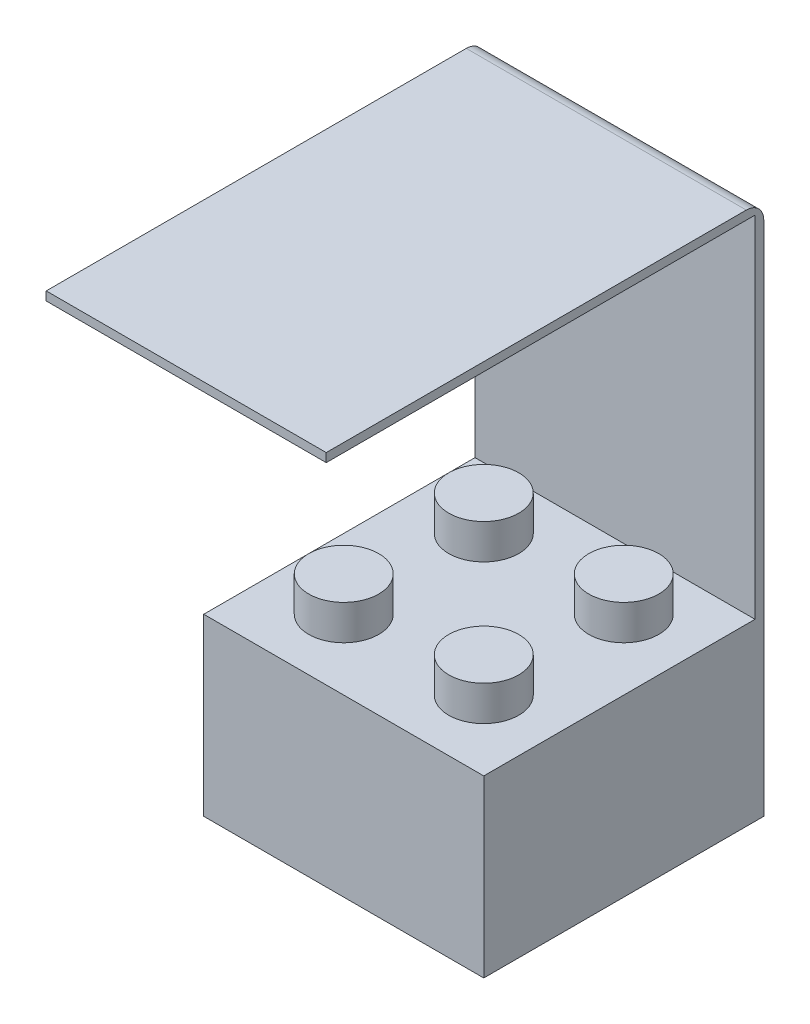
ISO-10303-21;
HEADER;
FILE_DESCRIPTION(('STEP AP214'),'2;1');
FILE_NAME('part.step','',(''),(''),'','','');
FILE_SCHEMA(('AUTOMOTIVE_DESIGN { 1 0 10303 214 1 1 1 1 }'));
ENDSEC;
DATA;
#1=APPLICATION_CONTEXT('core data for automotive mechanical design processes');
#2=APPLICATION_PROTOCOL_DEFINITION('international standard','automotive_design',2000,#1);
#3=PRODUCT_CONTEXT('',#1,'mechanical');
#4=PRODUCT('Part','Part','',(#3));
#5=PRODUCT_RELATED_PRODUCT_CATEGORY('part','',(#4));
#6=PRODUCT_DEFINITION_FORMATION('','',#4);
#7=PRODUCT_DEFINITION_CONTEXT('part definition',#1,'design');
#8=PRODUCT_DEFINITION('design','',#6,#7);
#9=PRODUCT_DEFINITION_SHAPE('','',#8);
#10=(LENGTH_UNIT() NAMED_UNIT(*) SI_UNIT(.MILLI.,.METRE.));
#11=(NAMED_UNIT(*) PLANE_ANGLE_UNIT() SI_UNIT($,.RADIAN.));
#12=(NAMED_UNIT(*) SI_UNIT($,.STERADIAN.) SOLID_ANGLE_UNIT());
#13=UNCERTAINTY_MEASURE_WITH_UNIT(LENGTH_MEASURE(1.E-05),#10,'distance_accuracy_value','');
#14=(GEOMETRIC_REPRESENTATION_CONTEXT(3) GLOBAL_UNCERTAINTY_ASSIGNED_CONTEXT((#13)) GLOBAL_UNIT_ASSIGNED_CONTEXT((#10,
#11,#12)) REPRESENTATION_CONTEXT('',''));
#15=CARTESIAN_POINT('',(0.,0.,0.));
#16=DIRECTION('',(0.,0.,1.));
#17=DIRECTION('',(1.,0.,0.));
#18=AXIS2_PLACEMENT_3D('',#15,#16,#17);
#19=CARTESIAN_POINT('',(0.,10.,0.));
#20=DIRECTION('',(0.,1.,0.));
#21=DIRECTION('',(0.,0.,1.));
#22=AXIS2_PLACEMENT_3D('',#19,#20,#21);
#23=PLANE('',#22);
#24=CARTESIAN_POINT('',(-4.00000000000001,10.,4.));
#25=DIRECTION('',(0.,1.,0.));
#26=DIRECTION('',(0.,0.,-1.));
#27=AXIS2_PLACEMENT_3D('',#24,#25,#26);
#28=CIRCLE('',#27,2.);
#29=CARTESIAN_POINT('',(-4.00000000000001,10.,2.));
#30=VERTEX_POINT('',#29);
#31=EDGE_CURVE('E226',#30,#30,#28,.T.);
#32=ORIENTED_EDGE('',*,*,#31,.F.);
#33=EDGE_LOOP('',(#32));
#34=FACE_BOUND('',#33,.T.);
#35=CARTESIAN_POINT('',(4.,10.,-4.00000000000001));
#36=DIRECTION('',(0.,1.,0.));
#37=DIRECTION('',(0.,0.,-1.));
#38=AXIS2_PLACEMENT_3D('',#35,#36,#37);
#39=CIRCLE('',#38,2.);
#40=CARTESIAN_POINT('',(4.,10.,-6.00000000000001));
#41=VERTEX_POINT('',#40);
#42=EDGE_CURVE('E261',#41,#41,#39,.T.);
#43=ORIENTED_EDGE('',*,*,#42,.F.);
#44=EDGE_LOOP('',(#43));
#45=FACE_BOUND('',#44,.T.);
#46=CARTESIAN_POINT('',(-4.,10.,-4.));
#47=DIRECTION('',(0.,1.,0.));
#48=DIRECTION('',(0.,0.,1.));
#49=AXIS2_PLACEMENT_3D('',#46,#47,#48);
#50=CIRCLE('',#49,2.);
#51=CARTESIAN_POINT('',(-4.,10.,-2.));
#52=VERTEX_POINT('',#51);
#53=EDGE_CURVE('E267',#52,#52,#50,.T.);
#54=ORIENTED_EDGE('',*,*,#53,.F.);
#55=EDGE_LOOP('',(#54));
#56=FACE_BOUND('',#55,.T.);
#57=CARTESIAN_POINT('',(4.,10.,4.00000000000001));
#58=DIRECTION('',(0.,1.,0.));
#59=DIRECTION('',(0.,0.,1.));
#60=AXIS2_PLACEMENT_3D('',#57,#58,#59);
#61=CIRCLE('',#60,2.);
#62=CARTESIAN_POINT('',(4.,10.,6.00000000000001));
#63=VERTEX_POINT('',#62);
#64=EDGE_CURVE('E255',#63,#63,#61,.T.);
#65=ORIENTED_EDGE('',*,*,#64,.F.);
#66=EDGE_LOOP('',(#65));
#67=FACE_BOUND('',#66,.T.);
#68=DIRECTION('',(0.,0.,-1.));
#69=VECTOR('',#68,1.);
#70=CARTESIAN_POINT('',(8.,10.,-8.));
#71=LINE('',#70,#69);
#72=CARTESIAN_POINT('',(8.,10.,8.));
#73=VERTEX_POINT('',#72);
#74=CARTESIAN_POINT('',(8.,10.,-7.5));
#75=VERTEX_POINT('',#74);
#76=EDGE_CURVE('E276',#73,#75,#71,.T.);
#77=ORIENTED_EDGE('',*,*,#76,.T.);
#78=DIRECTION('',(1.,0.,0.));
#79=VECTOR('',#78,1.);
#80=CARTESIAN_POINT('',(7.5,10.,-7.5));
#81=LINE('',#80,#79);
#82=CARTESIAN_POINT('',(-8.,10.,-7.5));
#83=VERTEX_POINT('',#82);
#84=EDGE_CURVE('E149',#83,#75,#81,.T.);
#85=ORIENTED_EDGE('',*,*,#84,.F.);
#86=DIRECTION('',(0.,0.,1.));
#87=VECTOR('',#86,1.);
#88=CARTESIAN_POINT('',(-8.,10.,-8.));
#89=LINE('',#88,#87);
#90=CARTESIAN_POINT('',(-8.,10.,8.));
#91=VERTEX_POINT('',#90);
#92=EDGE_CURVE('E278',#83,#91,#89,.T.);
#93=ORIENTED_EDGE('',*,*,#92,.T.);
#94=DIRECTION('',(1.,0.,0.));
#95=VECTOR('',#94,1.);
#96=CARTESIAN_POINT('',(-8.,10.,8.));
#97=LINE('',#96,#95);
#98=EDGE_CURVE('E281',#91,#73,#97,.T.);
#99=ORIENTED_EDGE('',*,*,#98,.T.);
#100=EDGE_LOOP('',(#77,#85,#93,#99));
#101=FACE_BOUND('',#100,.T.);
#102=ADVANCED_FACE('F33',(#34,#45,#56,#67,#101),#23,.T.);
#103=CARTESIAN_POINT('',(0.,9.,0.));
#104=DIRECTION('',(0.,1.,0.));
#105=DIRECTION('',(0.,0.,1.));
#106=AXIS2_PLACEMENT_3D('',#103,#104,#105);
#107=PLANE('',#106);
#108=CARTESIAN_POINT('',(4.,9.,4.00000000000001));
#109=DIRECTION('',(0.,1.,0.));
#110=DIRECTION('',(0.,0.,1.));
#111=AXIS2_PLACEMENT_3D('',#108,#109,#110);
#112=CIRCLE('',#111,1.);
#113=CARTESIAN_POINT('',(4.,9.,5.00000000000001));
#114=VERTEX_POINT('',#113);
#115=EDGE_CURVE('E197',#114,#114,#112,.T.);
#116=ORIENTED_EDGE('',*,*,#115,.T.);
#117=EDGE_LOOP('',(#116));
#118=FACE_BOUND('',#117,.T.);
#119=CARTESIAN_POINT('',(-4.,9.,-4.));
#120=DIRECTION('',(0.,1.,0.));
#121=DIRECTION('',(0.,0.,1.));
#122=AXIS2_PLACEMENT_3D('',#119,#120,#121);
#123=CIRCLE('',#122,1.);
#124=CARTESIAN_POINT('',(-4.,9.,-3.));
#125=VERTEX_POINT('',#124);
#126=EDGE_CURVE('E202',#125,#125,#123,.T.);
#127=ORIENTED_EDGE('',*,*,#126,.T.);
#128=EDGE_LOOP('',(#127));
#129=FACE_BOUND('',#128,.T.);
#130=DIRECTION('',(0.,0.,-1.));
#131=VECTOR('',#130,1.);
#132=CARTESIAN_POINT('',(7.,9.,-8.));
#133=LINE('',#132,#131);
#134=CARTESIAN_POINT('',(7.,9.,7.));
#135=VERTEX_POINT('',#134);
#136=CARTESIAN_POINT('',(7.,9.,-7.));
#137=VERTEX_POINT('',#136);
#138=EDGE_CURVE('E207',#135,#137,#133,.T.);
#139=ORIENTED_EDGE('',*,*,#138,.F.);
#140=DIRECTION('',(1.,0.,0.));
#141=VECTOR('',#140,1.);
#142=CARTESIAN_POINT('',(-8.,9.,7.));
#143=LINE('',#142,#141);
#144=CARTESIAN_POINT('',(-7.,9.,7.));
#145=VERTEX_POINT('',#144);
#146=EDGE_CURVE('E215',#145,#135,#143,.T.);
#147=ORIENTED_EDGE('',*,*,#146,.F.);
#148=DIRECTION('',(0.,0.,1.));
#149=VECTOR('',#148,1.);
#150=CARTESIAN_POINT('',(-7.,9.,-8.));
#151=LINE('',#150,#149);
#152=CARTESIAN_POINT('',(-7.,9.,-7.));
#153=VERTEX_POINT('',#152);
#154=EDGE_CURVE('E213',#153,#145,#151,.T.);
#155=ORIENTED_EDGE('',*,*,#154,.F.);
#156=DIRECTION('',(-1.,0.,0.));
#157=VECTOR('',#156,1.);
#158=CARTESIAN_POINT('',(-8.,9.,-7.));
#159=LINE('',#158,#157);
#160=EDGE_CURVE('E210',#137,#153,#159,.T.);
#161=ORIENTED_EDGE('',*,*,#160,.F.);
#162=EDGE_LOOP('',(#139,#147,#155,#161));
#163=FACE_BOUND('',#162,.T.);
#164=CARTESIAN_POINT('',(4.,9.,-4.00000000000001));
#165=DIRECTION('',(0.,1.,0.));
#166=DIRECTION('',(0.,0.,1.));
#167=AXIS2_PLACEMENT_3D('',#164,#165,#166);
#168=CIRCLE('',#167,1.);
#169=CARTESIAN_POINT('',(4.,9.,-3.));
#170=VERTEX_POINT('',#169);
#171=EDGE_CURVE('E218',#170,#170,#168,.T.);
#172=ORIENTED_EDGE('',*,*,#171,.T.);
#173=EDGE_LOOP('',(#172));
#174=FACE_BOUND('',#173,.T.);
#175=CARTESIAN_POINT('',(-4.00000000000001,9.,4.));
#176=DIRECTION('',(0.,1.,0.));
#177=DIRECTION('',(0.,0.,1.));
#178=AXIS2_PLACEMENT_3D('',#175,#176,#177);
#179=CIRCLE('',#178,1.);
#180=CARTESIAN_POINT('',(-4.00000000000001,9.,5.));
#181=VERTEX_POINT('',#180);
#182=EDGE_CURVE('E196',#181,#181,#179,.T.);
#183=ORIENTED_EDGE('',*,*,#182,.T.);
#184=EDGE_LOOP('',(#183));
#185=FACE_BOUND('',#184,.T.);
#186=CARTESIAN_POINT('',(0.,9.,0.));
#187=DIRECTION('',(0.,1.,0.));
#188=DIRECTION('',(0.,0.,1.));
#189=AXIS2_PLACEMENT_3D('',#186,#187,#188);
#190=CIRCLE('',#189,2.7);
#191=CARTESIAN_POINT('',(0.,9.,2.7));
#192=VERTEX_POINT('',#191);
#193=EDGE_CURVE('E301',#192,#192,#190,.F.);
#194=ORIENTED_EDGE('',*,*,#193,.F.);
#195=EDGE_LOOP('',(#194));
#196=FACE_BOUND('',#195,.T.);
#197=ADVANCED_FACE('F310',(#118,#129,#163,#174,#185,#196),#107,.F.);
#198=CARTESIAN_POINT('',(8.,10.,-8.));
#199=DIRECTION('',(-1.,0.,0.));
#200=DIRECTION('',(0.,0.,1.));
#201=AXIS2_PLACEMENT_3D('',#198,#199,#200);
#202=PLANE('',#201);
#203=DIRECTION('',(0.,-1.,0.));
#204=VECTOR('',#203,1.);
#205=CARTESIAN_POINT('',(8.,10.,-8.));
#206=LINE('',#205,#204);
#207=CARTESIAN_POINT('',(8.,29.5,-8.));
#208=VERTEX_POINT('',#207);
#209=CARTESIAN_POINT('',(8.,0.,-8.));
#210=VERTEX_POINT('',#209);
#211=EDGE_CURVE('E299',#208,#210,#206,.T.);
#212=ORIENTED_EDGE('',*,*,#211,.F.);
#213=CARTESIAN_POINT('',(8.,29.5,-7.));
#214=DIRECTION('',(-1.,0.,0.));
#215=DIRECTION('',(0.,0.,1.));
#216=AXIS2_PLACEMENT_3D('',#213,#214,#215);
#217=CIRCLE('',#216,1.);
#218=CARTESIAN_POINT('',(8.,30.5,-7.));
#219=VERTEX_POINT('',#218);
#220=EDGE_CURVE('E11',#208,#219,#217,.F.);
#221=ORIENTED_EDGE('',*,*,#220,.T.);
#222=DIRECTION('',(0.,0.,-1.));
#223=VECTOR('',#222,1.);
#224=CARTESIAN_POINT('',(8.,30.5,-8.));
#225=LINE('',#224,#223);
#226=CARTESIAN_POINT('',(8.,30.5,17.));
#227=VERTEX_POINT('',#226);
#228=EDGE_CURVE('E143',#227,#219,#225,.T.);
#229=ORIENTED_EDGE('',*,*,#228,.F.);
#230=DIRECTION('',(0.,-1.,0.));
#231=VECTOR('',#230,1.);
#232=CARTESIAN_POINT('',(8.,30.5,17.));
#233=LINE('',#232,#231);
#234=CARTESIAN_POINT('',(8.,30.,17.));
#235=VERTEX_POINT('',#234);
#236=EDGE_CURVE('E141',#227,#235,#233,.T.);
#237=ORIENTED_EDGE('',*,*,#236,.T.);
#238=DIRECTION('',(0.,0.,-1.));
#239=VECTOR('',#238,1.);
#240=CARTESIAN_POINT('',(8.,30.,-8.));
#241=LINE('',#240,#239);
#242=CARTESIAN_POINT('',(8.,30.,-7.5));
#243=VERTEX_POINT('',#242);
#244=EDGE_CURVE('E134',#235,#243,#241,.T.);
#245=ORIENTED_EDGE('',*,*,#244,.T.);
#246=DIRECTION('',(0.,-1.,0.));
#247=VECTOR('',#246,1.);
#248=CARTESIAN_POINT('',(8.,30.,-7.5));
#249=LINE('',#248,#247);
#250=EDGE_CURVE('E171',#243,#75,#249,.T.);
#251=ORIENTED_EDGE('',*,*,#250,.T.);
#252=ORIENTED_EDGE('',*,*,#76,.F.);
#253=DIRECTION('',(0.,-1.,0.));
#254=VECTOR('',#253,1.);
#255=CARTESIAN_POINT('',(8.,10.,8.));
#256=LINE('',#255,#254);
#257=CARTESIAN_POINT('',(8.,0.,8.));
#258=VERTEX_POINT('',#257);
#259=EDGE_CURVE('E283',#73,#258,#256,.T.);
#260=ORIENTED_EDGE('',*,*,#259,.T.);
#261=DIRECTION('',(0.,0.,-1.));
#262=VECTOR('',#261,1.);
#263=CARTESIAN_POINT('',(8.,0.,-8.));
#264=LINE('',#263,#262);
#265=EDGE_CURVE('E273',#258,#210,#264,.T.);
#266=ORIENTED_EDGE('',*,*,#265,.T.);
#267=EDGE_LOOP('',(#212,#221,#229,#237,#245,#251,#252,#260,#266));
#268=FACE_BOUND('',#267,.T.);
#269=ADVANCED_FACE('F169',(#268),#202,.F.);
#270=CARTESIAN_POINT('',(-8.,10.,-8.));
#271=DIRECTION('',(0.,0.,1.));
#272=DIRECTION('',(1.,0.,0.));
#273=AXIS2_PLACEMENT_3D('',#270,#271,#272);
#274=PLANE('',#273);
#275=DIRECTION('',(0.,-1.,0.));
#276=VECTOR('',#275,1.);
#277=CARTESIAN_POINT('',(-8.,10.,-8.));
#278=LINE('',#277,#276);
#279=CARTESIAN_POINT('',(-8.,29.5,-8.));
#280=VERTEX_POINT('',#279);
#281=CARTESIAN_POINT('',(-8.,0.,-8.));
#282=VERTEX_POINT('',#281);
#283=EDGE_CURVE('E297',#280,#282,#278,.T.);
#284=ORIENTED_EDGE('',*,*,#283,.F.);
#285=DIRECTION('',(-1.,0.,0.));
#286=VECTOR('',#285,1.);
#287=CARTESIAN_POINT('',(8.,29.5,-8.));
#288=LINE('',#287,#286);
#289=EDGE_CURVE('E41',#280,#208,#288,.F.);
#290=ORIENTED_EDGE('',*,*,#289,.T.);
#291=ORIENTED_EDGE('',*,*,#211,.T.);
#292=DIRECTION('',(-1.,0.,0.));
#293=VECTOR('',#292,1.);
#294=CARTESIAN_POINT('',(-8.,0.,-8.));
#295=LINE('',#294,#293);
#296=EDGE_CURVE('E286',#210,#282,#295,.T.);
#297=ORIENTED_EDGE('',*,*,#296,.T.);
#298=EDGE_LOOP('',(#284,#290,#291,#297));
#299=FACE_BOUND('',#298,.T.);
#300=ADVANCED_FACE('F319',(#299),#274,.F.);
#301=CARTESIAN_POINT('',(-8.,10.,-8.));
#302=DIRECTION('',(1.,0.,0.));
#303=DIRECTION('',(0.,0.,-1.));
#304=AXIS2_PLACEMENT_3D('',#301,#302,#303);
#305=PLANE('',#304);
#306=DIRECTION('',(0.,0.,1.));
#307=VECTOR('',#306,1.);
#308=CARTESIAN_POINT('',(-8.,30.5,-8.));
#309=LINE('',#308,#307);
#310=CARTESIAN_POINT('',(-8.,30.5,-7.));
#311=VERTEX_POINT('',#310);
#312=CARTESIAN_POINT('',(-8.,30.5,17.));
#313=VERTEX_POINT('',#312);
#314=EDGE_CURVE('E125',#311,#313,#309,.T.);
#315=ORIENTED_EDGE('',*,*,#314,.F.);
#316=CARTESIAN_POINT('',(-8.,29.5,-7.));
#317=DIRECTION('',(1.,0.,0.));
#318=DIRECTION('',(0.,0.,-1.));
#319=AXIS2_PLACEMENT_3D('',#316,#317,#318);
#320=CIRCLE('',#319,1.);
#321=EDGE_CURVE('E55',#311,#280,#320,.F.);
#322=ORIENTED_EDGE('',*,*,#321,.T.);
#323=ORIENTED_EDGE('',*,*,#283,.T.);
#324=DIRECTION('',(0.,0.,1.));
#325=VECTOR('',#324,1.);
#326=CARTESIAN_POINT('',(-8.,0.,-8.));
#327=LINE('',#326,#325);
#328=CARTESIAN_POINT('',(-8.,0.,8.));
#329=VERTEX_POINT('',#328);
#330=EDGE_CURVE('E289',#282,#329,#327,.T.);
#331=ORIENTED_EDGE('',*,*,#330,.T.);
#332=DIRECTION('',(0.,-1.,0.));
#333=VECTOR('',#332,1.);
#334=CARTESIAN_POINT('',(-8.,10.,8.));
#335=LINE('',#334,#333);
#336=EDGE_CURVE('E294',#91,#329,#335,.T.);
#337=ORIENTED_EDGE('',*,*,#336,.F.);
#338=ORIENTED_EDGE('',*,*,#92,.F.);
#339=DIRECTION('',(0.,-1.,0.));
#340=VECTOR('',#339,1.);
#341=CARTESIAN_POINT('',(-8.,30.,-7.5));
#342=LINE('',#341,#340);
#343=CARTESIAN_POINT('',(-8.,30.,-7.5));
#344=VERTEX_POINT('',#343);
#345=EDGE_CURVE('E178',#344,#83,#342,.T.);
#346=ORIENTED_EDGE('',*,*,#345,.F.);
#347=DIRECTION('',(0.,0.,1.));
#348=VECTOR('',#347,1.);
#349=CARTESIAN_POINT('',(-8.,30.,-8.));
#350=LINE('',#349,#348);
#351=CARTESIAN_POINT('',(-8.,30.,17.));
#352=VERTEX_POINT('',#351);
#353=EDGE_CURVE('E147',#344,#352,#350,.T.);
#354=ORIENTED_EDGE('',*,*,#353,.T.);
#355=DIRECTION('',(0.,-1.,0.));
#356=VECTOR('',#355,1.);
#357=CARTESIAN_POINT('',(-8.,30.5,17.));
#358=LINE('',#357,#356);
#359=EDGE_CURVE('E139',#313,#352,#358,.T.);
#360=ORIENTED_EDGE('',*,*,#359,.F.);
#361=EDGE_LOOP('',(#315,#322,#323,#331,#337,#338,#346,#354,#360));
#362=FACE_BOUND('',#361,.T.);
#363=ADVANCED_FACE('F145',(#362),#305,.F.);
#364=CARTESIAN_POINT('',(-8.,10.,8.));
#365=DIRECTION('',(0.,0.,-1.));
#366=DIRECTION('',(-1.,0.,0.));
#367=AXIS2_PLACEMENT_3D('',#364,#365,#366);
#368=PLANE('',#367);
#369=DIRECTION('',(1.,0.,0.));
#370=VECTOR('',#369,1.);
#371=CARTESIAN_POINT('',(-8.,0.,8.));
#372=LINE('',#371,#370);
#373=EDGE_CURVE('E279',#329,#258,#372,.T.);
#374=ORIENTED_EDGE('',*,*,#373,.T.);
#375=ORIENTED_EDGE('',*,*,#259,.F.);
#376=ORIENTED_EDGE('',*,*,#98,.F.);
#377=ORIENTED_EDGE('',*,*,#336,.T.);
#378=EDGE_LOOP('',(#374,#375,#376,#377));
#379=FACE_BOUND('',#378,.T.);
#380=ADVANCED_FACE('F404',(#379),#368,.F.);
#381=CARTESIAN_POINT('',(0.,0.,0.));
#382=DIRECTION('',(0.,1.,0.));
#383=DIRECTION('',(0.,0.,1.));
#384=AXIS2_PLACEMENT_3D('',#381,#382,#383);
#385=PLANE('',#384);
#386=DIRECTION('',(1.,0.,0.));
#387=VECTOR('',#386,1.);
#388=CARTESIAN_POINT('',(-8.,0.,7.));
#389=LINE('',#388,#387);
#390=CARTESIAN_POINT('',(-7.,0.,7.));
#391=VERTEX_POINT('',#390);
#392=CARTESIAN_POINT('',(7.,0.,7.));
#393=VERTEX_POINT('',#392);
#394=EDGE_CURVE('E211',#391,#393,#389,.T.);
#395=ORIENTED_EDGE('',*,*,#394,.T.);
#396=DIRECTION('',(0.,0.,-1.));
#397=VECTOR('',#396,1.);
#398=CARTESIAN_POINT('',(7.,0.,-8.));
#399=LINE('',#398,#397);
#400=CARTESIAN_POINT('',(7.,0.,-7.));
#401=VERTEX_POINT('',#400);
#402=EDGE_CURVE('E235',#393,#401,#399,.T.);
#403=ORIENTED_EDGE('',*,*,#402,.T.);
#404=DIRECTION('',(-1.,0.,0.));
#405=VECTOR('',#404,1.);
#406=CARTESIAN_POINT('',(-8.,0.,-7.));
#407=LINE('',#406,#405);
#408=CARTESIAN_POINT('',(-7.,0.,-7.));
#409=VERTEX_POINT('',#408);
#410=EDGE_CURVE('E244',#401,#409,#407,.T.);
#411=ORIENTED_EDGE('',*,*,#410,.T.);
#412=DIRECTION('',(0.,0.,1.));
#413=VECTOR('',#412,1.);
#414=CARTESIAN_POINT('',(-7.,0.,-8.));
#415=LINE('',#414,#413);
#416=EDGE_CURVE('E247',#409,#391,#415,.T.);
#417=ORIENTED_EDGE('',*,*,#416,.T.);
#418=EDGE_LOOP('',(#395,#403,#411,#417));
#419=FACE_BOUND('',#418,.T.);
#420=ORIENTED_EDGE('',*,*,#265,.F.);
#421=ORIENTED_EDGE('',*,*,#373,.F.);
#422=ORIENTED_EDGE('',*,*,#330,.F.);
#423=ORIENTED_EDGE('',*,*,#296,.F.);
#424=EDGE_LOOP('',(#420,#421,#422,#423));
#425=FACE_BOUND('',#424,.T.);
#426=ADVANCED_FACE('F399',(#419,#425),#385,.F.);
#427=CARTESIAN_POINT('',(-4.,12.,-4.));
#428=DIRECTION('',(0.,-1.,0.));
#429=DIRECTION('',(0.,0.,-1.));
#430=AXIS2_PLACEMENT_3D('',#427,#428,#429);
#431=CYLINDRICAL_SURFACE('',#430,2.);
#432=CARTESIAN_POINT('',(-4.,12.,-4.));
#433=DIRECTION('',(0.,1.,0.));
#434=DIRECTION('',(0.,0.,1.));
#435=AXIS2_PLACEMENT_3D('',#432,#433,#434);
#436=CIRCLE('',#435,2.);
#437=CARTESIAN_POINT('',(-4.,12.,-2.));
#438=VERTEX_POINT('',#437);
#439=EDGE_CURVE('E270',#438,#438,#436,.T.);
#440=ORIENTED_EDGE('',*,*,#439,.F.);
#441=EDGE_LOOP('',(#440));
#442=FACE_BOUND('',#441,.T.);
#443=ORIENTED_EDGE('',*,*,#53,.T.);
#444=EDGE_LOOP('',(#443));
#445=FACE_BOUND('',#444,.T.);
#446=ADVANCED_FACE('F396',(#442,#445),#431,.T.);
#447=CARTESIAN_POINT('',(-4.,12.,-4.));
#448=DIRECTION('',(0.,1.,0.));
#449=DIRECTION('',(0.,0.,1.));
#450=AXIS2_PLACEMENT_3D('',#447,#448,#449);
#451=PLANE('',#450);
#452=ORIENTED_EDGE('',*,*,#439,.T.);
#453=EDGE_LOOP('',(#452));
#454=FACE_BOUND('',#453,.T.);
#455=ADVANCED_FACE('F392',(#454),#451,.T.);
#456=CARTESIAN_POINT('',(4.,12.,-4.00000000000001));
#457=DIRECTION('',(0.,-1.,0.));
#458=DIRECTION('',(0.,0.,-1.));
#459=AXIS2_PLACEMENT_3D('',#456,#457,#458);
#460=CYLINDRICAL_SURFACE('',#459,2.);
#461=CARTESIAN_POINT('',(4.,12.,-4.00000000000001));
#462=DIRECTION('',(0.,1.,0.));
#463=DIRECTION('',(0.,0.,-1.));
#464=AXIS2_PLACEMENT_3D('',#461,#462,#463);
#465=CIRCLE('',#464,2.);
#466=CARTESIAN_POINT('',(4.,12.,-6.00000000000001));
#467=VERTEX_POINT('',#466);
#468=EDGE_CURVE('E264',#467,#467,#465,.T.);
#469=ORIENTED_EDGE('',*,*,#468,.F.);
#470=EDGE_LOOP('',(#469));
#471=FACE_BOUND('',#470,.T.);
#472=ORIENTED_EDGE('',*,*,#42,.T.);
#473=EDGE_LOOP('',(#472));
#474=FACE_BOUND('',#473,.T.);
#475=ADVANCED_FACE('F388',(#471,#474),#460,.T.);
#476=CARTESIAN_POINT('',(4.,12.,-4.00000000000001));
#477=DIRECTION('',(0.,-1.,0.));
#478=DIRECTION('',(0.,0.,-1.));
#479=AXIS2_PLACEMENT_3D('',#476,#477,#478);
#480=PLANE('',#479);
#481=ORIENTED_EDGE('',*,*,#468,.T.);
#482=EDGE_LOOP('',(#481));
#483=FACE_BOUND('',#482,.T.);
#484=ADVANCED_FACE('F384',(#483),#480,.F.);
#485=CARTESIAN_POINT('',(4.,12.,4.00000000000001));
#486=DIRECTION('',(0.,-1.,0.));
#487=DIRECTION('',(0.,0.,-1.));
#488=AXIS2_PLACEMENT_3D('',#485,#486,#487);
#489=CYLINDRICAL_SURFACE('',#488,2.);
#490=CARTESIAN_POINT('',(4.,12.,4.00000000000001));
#491=DIRECTION('',(0.,1.,0.));
#492=DIRECTION('',(0.,0.,1.));
#493=AXIS2_PLACEMENT_3D('',#490,#491,#492);
#494=CIRCLE('',#493,2.);
#495=CARTESIAN_POINT('',(4.,12.,6.00000000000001));
#496=VERTEX_POINT('',#495);
#497=EDGE_CURVE('E258',#496,#496,#494,.T.);
#498=ORIENTED_EDGE('',*,*,#497,.F.);
#499=EDGE_LOOP('',(#498));
#500=FACE_BOUND('',#499,.T.);
#501=ORIENTED_EDGE('',*,*,#64,.T.);
#502=EDGE_LOOP('',(#501));
#503=FACE_BOUND('',#502,.T.);
#504=ADVANCED_FACE('F380',(#500,#503),#489,.T.);
#505=CARTESIAN_POINT('',(4.,12.,4.00000000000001));
#506=DIRECTION('',(0.,1.,0.));
#507=DIRECTION('',(0.,0.,1.));
#508=AXIS2_PLACEMENT_3D('',#505,#506,#507);
#509=PLANE('',#508);
#510=ORIENTED_EDGE('',*,*,#497,.T.);
#511=EDGE_LOOP('',(#510));
#512=FACE_BOUND('',#511,.T.);
#513=ADVANCED_FACE('F376',(#512),#509,.T.);
#514=CARTESIAN_POINT('',(-4.00000000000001,12.,4.));
#515=DIRECTION('',(0.,-1.,0.));
#516=DIRECTION('',(0.,0.,-1.));
#517=AXIS2_PLACEMENT_3D('',#514,#515,#516);
#518=CYLINDRICAL_SURFACE('',#517,2.);
#519=CARTESIAN_POINT('',(-4.00000000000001,12.,4.));
#520=DIRECTION('',(0.,1.,0.));
#521=DIRECTION('',(0.,0.,-1.));
#522=AXIS2_PLACEMENT_3D('',#519,#520,#521);
#523=CIRCLE('',#522,2.);
#524=CARTESIAN_POINT('',(-4.00000000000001,12.,2.));
#525=VERTEX_POINT('',#524);
#526=EDGE_CURVE('E252',#525,#525,#523,.T.);
#527=ORIENTED_EDGE('',*,*,#526,.F.);
#528=EDGE_LOOP('',(#527));
#529=FACE_BOUND('',#528,.T.);
#530=ORIENTED_EDGE('',*,*,#31,.T.);
#531=EDGE_LOOP('',(#530));
#532=FACE_BOUND('',#531,.T.);
#533=ADVANCED_FACE('F372',(#529,#532),#518,.T.);
#534=CARTESIAN_POINT('',(-4.00000000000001,12.,4.));
#535=DIRECTION('',(0.,-1.,0.));
#536=DIRECTION('',(0.,0.,-1.));
#537=AXIS2_PLACEMENT_3D('',#534,#535,#536);
#538=PLANE('',#537);
#539=ORIENTED_EDGE('',*,*,#526,.T.);
#540=EDGE_LOOP('',(#539));
#541=FACE_BOUND('',#540,.T.);
#542=ADVANCED_FACE('F368',(#541),#538,.F.);
#543=CARTESIAN_POINT('',(7.,10.,-8.));
#544=DIRECTION('',(-1.,0.,0.));
#545=DIRECTION('',(0.,0.,1.));
#546=AXIS2_PLACEMENT_3D('',#543,#544,#545);
#547=PLANE('',#546);
#548=ORIENTED_EDGE('',*,*,#402,.F.);
#549=DIRECTION('',(0.,-1.,0.));
#550=VECTOR('',#549,1.);
#551=CARTESIAN_POINT('',(7.,10.,7.));
#552=LINE('',#551,#550);
#553=EDGE_CURVE('E217',#135,#393,#552,.T.);
#554=ORIENTED_EDGE('',*,*,#553,.F.);
#555=ORIENTED_EDGE('',*,*,#138,.T.);
#556=DIRECTION('',(0.,-1.,0.));
#557=VECTOR('',#556,1.);
#558=CARTESIAN_POINT('',(7.,10.,-7.));
#559=LINE('',#558,#557);
#560=EDGE_CURVE('E223',#137,#401,#559,.T.);
#561=ORIENTED_EDGE('',*,*,#560,.T.);
#562=EDGE_LOOP('',(#548,#554,#555,#561));
#563=FACE_BOUND('',#562,.T.);
#564=ADVANCED_FACE('F371',(#563),#547,.T.);
#565=CARTESIAN_POINT('',(-8.,10.,-7.));
#566=DIRECTION('',(0.,0.,1.));
#567=DIRECTION('',(1.,0.,0.));
#568=AXIS2_PLACEMENT_3D('',#565,#566,#567);
#569=PLANE('',#568);
#570=ORIENTED_EDGE('',*,*,#410,.F.);
#571=ORIENTED_EDGE('',*,*,#560,.F.);
#572=ORIENTED_EDGE('',*,*,#160,.T.);
#573=DIRECTION('',(0.,-1.,0.));
#574=VECTOR('',#573,1.);
#575=CARTESIAN_POINT('',(-7.,10.,-7.));
#576=LINE('',#575,#574);
#577=EDGE_CURVE('E227',#153,#409,#576,.T.);
#578=ORIENTED_EDGE('',*,*,#577,.T.);
#579=EDGE_LOOP('',(#570,#571,#572,#578));
#580=FACE_BOUND('',#579,.T.);
#581=ADVANCED_FACE('F607',(#580),#569,.T.);
#582=CARTESIAN_POINT('',(-7.,10.,-8.));
#583=DIRECTION('',(1.,0.,0.));
#584=DIRECTION('',(0.,0.,-1.));
#585=AXIS2_PLACEMENT_3D('',#582,#583,#584);
#586=PLANE('',#585);
#587=ORIENTED_EDGE('',*,*,#416,.F.);
#588=ORIENTED_EDGE('',*,*,#577,.F.);
#589=ORIENTED_EDGE('',*,*,#154,.T.);
#590=DIRECTION('',(0.,-1.,0.));
#591=VECTOR('',#590,1.);
#592=CARTESIAN_POINT('',(-7.,10.,7.));
#593=LINE('',#592,#591);
#594=EDGE_CURVE('E229',#145,#391,#593,.T.);
#595=ORIENTED_EDGE('',*,*,#594,.T.);
#596=EDGE_LOOP('',(#587,#588,#589,#595));
#597=FACE_BOUND('',#596,.T.);
#598=ADVANCED_FACE('F597',(#597),#586,.T.);
#599=CARTESIAN_POINT('',(-8.,10.,7.));
#600=DIRECTION('',(0.,0.,-1.));
#601=DIRECTION('',(-1.,0.,0.));
#602=AXIS2_PLACEMENT_3D('',#599,#600,#601);
#603=PLANE('',#602);
#604=ORIENTED_EDGE('',*,*,#394,.F.);
#605=ORIENTED_EDGE('',*,*,#594,.F.);
#606=ORIENTED_EDGE('',*,*,#146,.T.);
#607=ORIENTED_EDGE('',*,*,#553,.T.);
#608=EDGE_LOOP('',(#604,#605,#606,#607));
#609=FACE_BOUND('',#608,.T.);
#610=ADVANCED_FACE('F587',(#609),#603,.T.);
#611=CARTESIAN_POINT('',(-4.,12.,-4.));
#612=DIRECTION('',(0.,-1.,0.));
#613=DIRECTION('',(0.,0.,-1.));
#614=AXIS2_PLACEMENT_3D('',#611,#612,#613);
#615=CYLINDRICAL_SURFACE('',#614,1.);
#616=CARTESIAN_POINT('',(-4.,11.,-4.));
#617=DIRECTION('',(0.,1.,0.));
#618=DIRECTION('',(0.,0.,1.));
#619=AXIS2_PLACEMENT_3D('',#616,#617,#618);
#620=CIRCLE('',#619,1.);
#621=CARTESIAN_POINT('',(-4.,11.,-3.));
#622=VERTEX_POINT('',#621);
#623=EDGE_CURVE('E205',#622,#622,#620,.T.);
#624=ORIENTED_EDGE('',*,*,#623,.T.);
#625=EDGE_LOOP('',(#624));
#626=FACE_BOUND('',#625,.T.);
#627=ORIENTED_EDGE('',*,*,#126,.F.);
#628=EDGE_LOOP('',(#627));
#629=FACE_BOUND('',#628,.T.);
#630=ADVANCED_FACE('F577',(#626,#629),#615,.F.);
#631=CARTESIAN_POINT('',(-4.,11.,-4.));
#632=DIRECTION('',(0.,1.,0.));
#633=DIRECTION('',(0.,0.,1.));
#634=AXIS2_PLACEMENT_3D('',#631,#632,#633);
#635=PLANE('',#634);
#636=ORIENTED_EDGE('',*,*,#623,.F.);
#637=EDGE_LOOP('',(#636));
#638=FACE_BOUND('',#637,.T.);
#639=ADVANCED_FACE('F567',(#638),#635,.F.);
#640=CARTESIAN_POINT('',(4.,12.,-4.00000000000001));
#641=DIRECTION('',(0.,-1.,0.));
#642=DIRECTION('',(0.,0.,-1.));
#643=AXIS2_PLACEMENT_3D('',#640,#641,#642);
#644=CYLINDRICAL_SURFACE('',#643,1.);
#645=CARTESIAN_POINT('',(4.,11.,-4.00000000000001));
#646=DIRECTION('',(0.,-1.,0.));
#647=DIRECTION('',(0.,0.,-1.));
#648=AXIS2_PLACEMENT_3D('',#645,#646,#647);
#649=CIRCLE('',#648,1.);
#650=CARTESIAN_POINT('',(4.,11.,-5.00000000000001));
#651=VERTEX_POINT('',#650);
#652=EDGE_CURVE('E206',#651,#651,#649,.F.);
#653=ORIENTED_EDGE('',*,*,#652,.T.);
#654=EDGE_LOOP('',(#653));
#655=FACE_BOUND('',#654,.T.);
#656=ORIENTED_EDGE('',*,*,#171,.F.);
#657=EDGE_LOOP('',(#656));
#658=FACE_BOUND('',#657,.T.);
#659=ADVANCED_FACE('F557',(#655,#658),#644,.F.);
#660=CARTESIAN_POINT('',(4.,11.,-4.00000000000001));
#661=DIRECTION('',(0.,-1.,0.));
#662=DIRECTION('',(0.,0.,-1.));
#663=AXIS2_PLACEMENT_3D('',#660,#661,#662);
#664=PLANE('',#663);
#665=ORIENTED_EDGE('',*,*,#652,.F.);
#666=EDGE_LOOP('',(#665));
#667=FACE_BOUND('',#666,.T.);
#668=ADVANCED_FACE('F547',(#667),#664,.T.);
#669=CARTESIAN_POINT('',(4.,12.,4.00000000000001));
#670=DIRECTION('',(0.,-1.,0.));
#671=DIRECTION('',(0.,0.,-1.));
#672=AXIS2_PLACEMENT_3D('',#669,#670,#671);
#673=CYLINDRICAL_SURFACE('',#672,1.);
#674=CARTESIAN_POINT('',(4.,11.,4.00000000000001));
#675=DIRECTION('',(0.,1.,0.));
#676=DIRECTION('',(0.,0.,1.));
#677=AXIS2_PLACEMENT_3D('',#674,#675,#676);
#678=CIRCLE('',#677,1.);
#679=CARTESIAN_POINT('',(4.,11.,5.00000000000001));
#680=VERTEX_POINT('',#679);
#681=EDGE_CURVE('E200',#680,#680,#678,.T.);
#682=ORIENTED_EDGE('',*,*,#681,.T.);
#683=EDGE_LOOP('',(#682));
#684=FACE_BOUND('',#683,.T.);
#685=ORIENTED_EDGE('',*,*,#115,.F.);
#686=EDGE_LOOP('',(#685));
#687=FACE_BOUND('',#686,.T.);
#688=ADVANCED_FACE('F538',(#684,#687),#673,.F.);
#689=CARTESIAN_POINT('',(4.,11.,4.00000000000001));
#690=DIRECTION('',(0.,1.,0.));
#691=DIRECTION('',(0.,0.,1.));
#692=AXIS2_PLACEMENT_3D('',#689,#690,#691);
#693=PLANE('',#692);
#694=ORIENTED_EDGE('',*,*,#681,.F.);
#695=EDGE_LOOP('',(#694));
#696=FACE_BOUND('',#695,.T.);
#697=ADVANCED_FACE('F362',(#696),#693,.F.);
#698=CARTESIAN_POINT('',(-4.00000000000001,12.,4.));
#699=DIRECTION('',(0.,-1.,0.));
#700=DIRECTION('',(0.,0.,-1.));
#701=AXIS2_PLACEMENT_3D('',#698,#699,#700);
#702=CYLINDRICAL_SURFACE('',#701,1.);
#703=CARTESIAN_POINT('',(-4.00000000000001,11.,4.));
#704=DIRECTION('',(0.,-1.,0.));
#705=DIRECTION('',(0.,0.,-1.));
#706=AXIS2_PLACEMENT_3D('',#703,#704,#705);
#707=CIRCLE('',#706,1.);
#708=CARTESIAN_POINT('',(-4.00000000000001,11.,3.));
#709=VERTEX_POINT('',#708);
#710=EDGE_CURVE('E201',#709,#709,#707,.F.);
#711=ORIENTED_EDGE('',*,*,#710,.T.);
#712=EDGE_LOOP('',(#711));
#713=FACE_BOUND('',#712,.T.);
#714=ORIENTED_EDGE('',*,*,#182,.F.);
#715=EDGE_LOOP('',(#714));
#716=FACE_BOUND('',#715,.T.);
#717=ADVANCED_FACE('F353',(#713,#716),#702,.F.);
#718=CARTESIAN_POINT('',(-4.00000000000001,11.,4.));
#719=DIRECTION('',(0.,-1.,0.));
#720=DIRECTION('',(0.,0.,-1.));
#721=AXIS2_PLACEMENT_3D('',#718,#719,#720);
#722=PLANE('',#721);
#723=ORIENTED_EDGE('',*,*,#710,.F.);
#724=EDGE_LOOP('',(#723));
#725=FACE_BOUND('',#724,.T.);
#726=ADVANCED_FACE('F348',(#725),#722,.T.);
#727=CARTESIAN_POINT('',(0.,0.,0.));
#728=DIRECTION('',(0.,-1.,0.));
#729=DIRECTION('',(0.,0.,-1.));
#730=AXIS2_PLACEMENT_3D('',#727,#728,#729);
#731=PLANE('',#730);
#732=CARTESIAN_POINT('',(0.,0.,0.));
#733=DIRECTION('',(0.,-1.,0.));
#734=DIRECTION('',(0.,0.,-1.));
#735=AXIS2_PLACEMENT_3D('',#732,#733,#734);
#736=CIRCLE('',#735,2.7);
#737=CARTESIAN_POINT('',(0.,0.,-2.7));
#738=VERTEX_POINT('',#737);
#739=EDGE_CURVE('E190',#738,#738,#736,.T.);
#740=ORIENTED_EDGE('',*,*,#739,.T.);
#741=EDGE_LOOP('',(#740));
#742=FACE_BOUND('',#741,.T.);
#743=CARTESIAN_POINT('',(0.,0.,0.));
#744=DIRECTION('',(0.,-1.,0.));
#745=DIRECTION('',(0.,0.,-1.));
#746=AXIS2_PLACEMENT_3D('',#743,#744,#745);
#747=CIRCLE('',#746,1.7);
#748=CARTESIAN_POINT('',(0.,0.,-1.7));
#749=VERTEX_POINT('',#748);
#750=EDGE_CURVE('E187',#749,#749,#747,.T.);
#751=ORIENTED_EDGE('',*,*,#750,.F.);
#752=EDGE_LOOP('',(#751));
#753=FACE_BOUND('',#752,.T.);
#754=ADVANCED_FACE('F343',(#742,#753),#731,.T.);
#755=CARTESIAN_POINT('',(0.,0.,0.));
#756=DIRECTION('',(0.,1.,0.));
#757=DIRECTION('',(0.,0.,1.));
#758=AXIS2_PLACEMENT_3D('',#755,#756,#757);
#759=CYLINDRICAL_SURFACE('',#758,2.7);
#760=ORIENTED_EDGE('',*,*,#739,.F.);
#761=EDGE_LOOP('',(#760));
#762=FACE_BOUND('',#761,.T.);
#763=ORIENTED_EDGE('',*,*,#193,.T.);
#764=EDGE_LOOP('',(#763));
#765=FACE_BOUND('',#764,.T.);
#766=ADVANCED_FACE('F308',(#762,#765),#759,.T.);
#767=CARTESIAN_POINT('',(0.,0.,0.));
#768=DIRECTION('',(0.,1.,0.));
#769=DIRECTION('',(0.,0.,1.));
#770=AXIS2_PLACEMENT_3D('',#767,#768,#769);
#771=CYLINDRICAL_SURFACE('',#770,1.7);
#772=ORIENTED_EDGE('',*,*,#750,.T.);
#773=EDGE_LOOP('',(#772));
#774=FACE_BOUND('',#773,.T.);
#775=CARTESIAN_POINT('',(0.,9.,0.));
#776=DIRECTION('',(0.,-1.,0.));
#777=DIRECTION('',(0.,0.,-1.));
#778=AXIS2_PLACEMENT_3D('',#775,#776,#777);
#779=CIRCLE('',#778,1.7);
#780=CARTESIAN_POINT('',(0.,9.,-1.7));
#781=VERTEX_POINT('',#780);
#782=EDGE_CURVE('E191',#781,#781,#779,.T.);
#783=ORIENTED_EDGE('',*,*,#782,.F.);
#784=EDGE_LOOP('',(#783));
#785=FACE_BOUND('',#784,.T.);
#786=ADVANCED_FACE('F328',(#774,#785),#771,.F.);
#787=ORIENTED_EDGE('',*,*,#782,.T.);
#788=EDGE_LOOP('',(#787));
#789=FACE_BOUND('',#788,.T.);
#790=ADVANCED_FACE('F314',(#789),#107,.F.);
#791=CARTESIAN_POINT('',(7.5,30.,-7.5));
#792=DIRECTION('',(0.,0.,-1.));
#793=DIRECTION('',(-1.,0.,0.));
#794=AXIS2_PLACEMENT_3D('',#791,#792,#793);
#795=PLANE('',#794);
#796=ORIENTED_EDGE('',*,*,#84,.T.);
#797=ORIENTED_EDGE('',*,*,#250,.F.);
#798=DIRECTION('',(1.,0.,0.));
#799=VECTOR('',#798,1.);
#800=CARTESIAN_POINT('',(-7.5,30.,-7.5));
#801=LINE('',#800,#799);
#802=EDGE_CURVE('E152',#344,#243,#801,.T.);
#803=ORIENTED_EDGE('',*,*,#802,.F.);
#804=ORIENTED_EDGE('',*,*,#345,.T.);
#805=EDGE_LOOP('',(#796,#797,#803,#804));
#806=FACE_BOUND('',#805,.T.);
#807=ADVANCED_FACE('F327',(#806),#795,.F.);
#808=CARTESIAN_POINT('',(0.,30.,0.));
#809=DIRECTION('',(0.,1.,0.));
#810=DIRECTION('',(0.,0.,1.));
#811=AXIS2_PLACEMENT_3D('',#808,#809,#810);
#812=PLANE('',#811);
#813=ORIENTED_EDGE('',*,*,#353,.F.);
#814=ORIENTED_EDGE('',*,*,#802,.T.);
#815=ORIENTED_EDGE('',*,*,#244,.F.);
#816=DIRECTION('',(1.,0.,0.));
#817=VECTOR('',#816,1.);
#818=CARTESIAN_POINT('',(-8.,30.,17.));
#819=LINE('',#818,#817);
#820=EDGE_CURVE('E159',#352,#235,#819,.T.);
#821=ORIENTED_EDGE('',*,*,#820,.F.);
#822=EDGE_LOOP('',(#813,#814,#815,#821));
#823=FACE_BOUND('',#822,.T.);
#824=ADVANCED_FACE('F174',(#823),#812,.F.);
#825=CARTESIAN_POINT('',(-8.,30.5,17.));
#826=DIRECTION('',(0.,0.,-1.));
#827=DIRECTION('',(-1.,0.,0.));
#828=AXIS2_PLACEMENT_3D('',#825,#826,#827);
#829=PLANE('',#828);
#830=ORIENTED_EDGE('',*,*,#820,.T.);
#831=ORIENTED_EDGE('',*,*,#236,.F.);
#832=DIRECTION('',(1.,0.,0.));
#833=VECTOR('',#832,1.);
#834=CARTESIAN_POINT('',(-8.,30.5,17.));
#835=LINE('',#834,#833);
#836=EDGE_CURVE('E129',#313,#227,#835,.T.);
#837=ORIENTED_EDGE('',*,*,#836,.F.);
#838=ORIENTED_EDGE('',*,*,#359,.T.);
#839=EDGE_LOOP('',(#830,#831,#837,#838));
#840=FACE_BOUND('',#839,.T.);
#841=ADVANCED_FACE('F138',(#840),#829,.F.);
#842=CARTESIAN_POINT('',(0.,30.5,0.));
#843=DIRECTION('',(0.,1.,0.));
#844=DIRECTION('',(0.,0.,1.));
#845=AXIS2_PLACEMENT_3D('',#842,#843,#844);
#846=PLANE('',#845);
#847=ORIENTED_EDGE('',*,*,#228,.T.);
#848=DIRECTION('',(-1.,0.,0.));
#849=VECTOR('',#848,1.);
#850=CARTESIAN_POINT('',(-8.,30.5,-7.));
#851=LINE('',#850,#849);
#852=EDGE_CURVE('E132',#219,#311,#851,.T.);
#853=ORIENTED_EDGE('',*,*,#852,.T.);
#854=ORIENTED_EDGE('',*,*,#314,.T.);
#855=ORIENTED_EDGE('',*,*,#836,.T.);
#856=EDGE_LOOP('',(#847,#853,#854,#855));
#857=FACE_BOUND('',#856,.T.);
#858=ADVANCED_FACE('F128',(#857),#846,.T.);
#859=CARTESIAN_POINT('',(0.,29.5,-7.));
#860=DIRECTION('',(1.,0.,0.));
#861=DIRECTION('',(0.,0.,-1.));
#862=AXIS2_PLACEMENT_3D('',#859,#860,#861);
#863=CYLINDRICAL_SURFACE('',#862,1.);
#864=ORIENTED_EDGE('',*,*,#220,.F.);
#865=ORIENTED_EDGE('',*,*,#289,.F.);
#866=ORIENTED_EDGE('',*,*,#321,.F.);
#867=ORIENTED_EDGE('',*,*,#852,.F.);
#868=EDGE_LOOP('',(#864,#865,#866,#867));
#869=FACE_BOUND('',#868,.T.);
#870=ADVANCED_FACE('F35',(#869),#863,.T.);
#871=CLOSED_SHELL('',(#102,#197,#269,#300,#363,#380,#426,#446,#455,#475,#484,#504,#513,#533,
#542,#564,#581,#598,#610,#630,#639,#659,#668,#688,#697,#717,#726,#754,#766,#786,#790,#807,#824,
#841,#858,#870));
#872=MANIFOLD_SOLID_BREP('B2',#871);
#873=ADVANCED_BREP_SHAPE_REPRESENTATION('',(#18,#872),#14);
#874=SHAPE_DEFINITION_REPRESENTATION(#9,#873);
ENDSEC;
END-ISO-10303-21;
